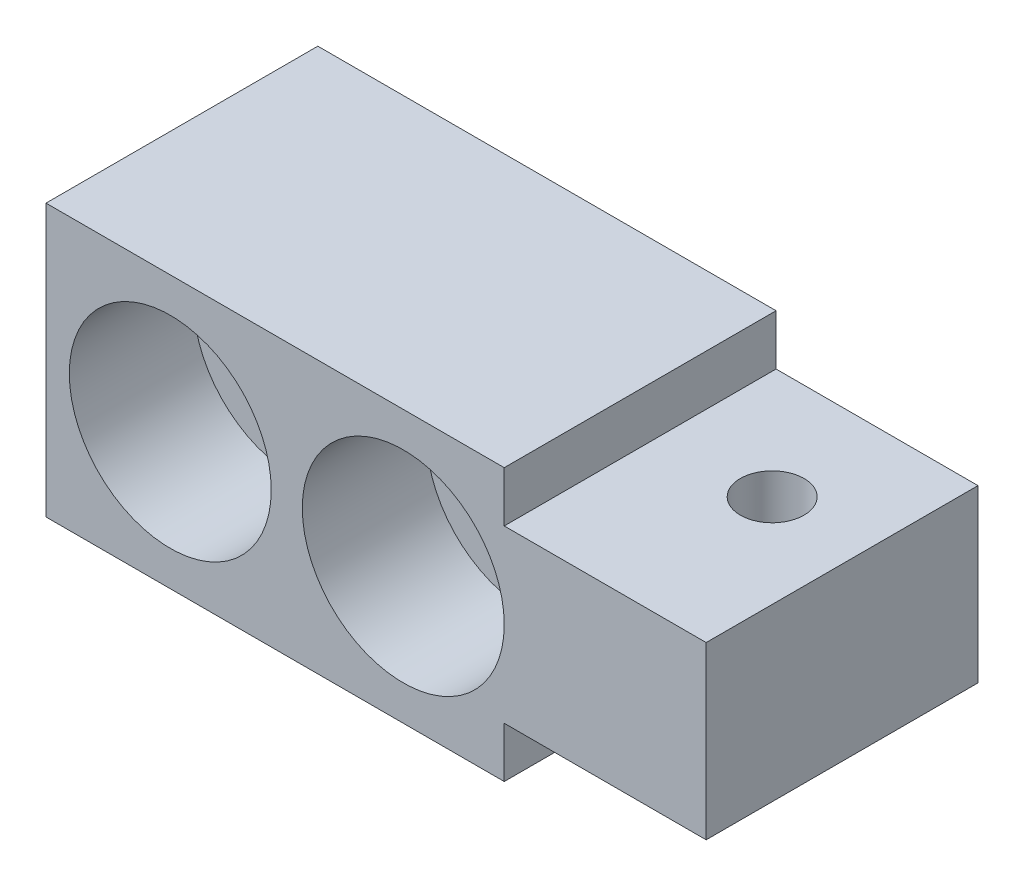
ISO-10303-21;
HEADER;
FILE_DESCRIPTION(('STEP AP214'),'2;1');
FILE_NAME('part.step','',(''),(''),'','','');
FILE_SCHEMA(('AUTOMOTIVE_DESIGN { 1 0 10303 214 1 1 1 1 }'));
ENDSEC;
DATA;
#1=APPLICATION_CONTEXT('core data for automotive mechanical design processes');
#2=APPLICATION_PROTOCOL_DEFINITION('international standard','automotive_design',2000,#1);
#3=PRODUCT_CONTEXT('',#1,'mechanical');
#4=PRODUCT('Part','Part','',(#3));
#5=PRODUCT_RELATED_PRODUCT_CATEGORY('part','',(#4));
#6=PRODUCT_DEFINITION_FORMATION('','',#4);
#7=PRODUCT_DEFINITION_CONTEXT('part definition',#1,'design');
#8=PRODUCT_DEFINITION('design','',#6,#7);
#9=PRODUCT_DEFINITION_SHAPE('','',#8);
#10=(LENGTH_UNIT() NAMED_UNIT(*) SI_UNIT(.MILLI.,.METRE.));
#11=(NAMED_UNIT(*) PLANE_ANGLE_UNIT() SI_UNIT($,.RADIAN.));
#12=(NAMED_UNIT(*) SI_UNIT($,.STERADIAN.) SOLID_ANGLE_UNIT());
#13=UNCERTAINTY_MEASURE_WITH_UNIT(LENGTH_MEASURE(1.E-05),#10,'distance_accuracy_value','');
#14=(GEOMETRIC_REPRESENTATION_CONTEXT(3) GLOBAL_UNCERTAINTY_ASSIGNED_CONTEXT((#13)) GLOBAL_UNIT_ASSIGNED_CONTEXT((#10,
#11,#12)) REPRESENTATION_CONTEXT('',''));
#15=CARTESIAN_POINT('',(0.,0.,0.));
#16=DIRECTION('',(0.,0.,1.));
#17=DIRECTION('',(1.,0.,0.));
#18=AXIS2_PLACEMENT_3D('',#15,#16,#17);
#19=CARTESIAN_POINT('',(69.,17.5,35.));
#20=DIRECTION('',(0.,0.,-1.));
#21=DIRECTION('',(1.,0.,0.));
#22=AXIS2_PLACEMENT_3D('',#19,#20,#21);
#23=PLANE('',#22);
#24=CARTESIAN_POINT('',(0.,0.,35.));
#25=DIRECTION('',(0.,0.,1.));
#26=DIRECTION('',(-1.,0.,0.));
#27=AXIS2_PLACEMENT_3D('',#24,#25,#26);
#28=CIRCLE('',#27,13.);
#29=CARTESIAN_POINT('',(-13.,0.,35.));
#30=VERTEX_POINT('',#29);
#31=EDGE_CURVE('E157',#30,#30,#28,.T.);
#32=ORIENTED_EDGE('',*,*,#31,.F.);
#33=EDGE_LOOP('',(#32));
#34=FACE_BOUND('',#33,.T.);
#35=DIRECTION('',(0.,1.,0.));
#36=VECTOR('',#35,1.);
#37=CARTESIAN_POINT('',(43.,11.,35.));
#38=LINE('',#37,#36);
#39=CARTESIAN_POINT('',(43.,11.,35.));
#40=VERTEX_POINT('',#39);
#41=CARTESIAN_POINT('',(43.,17.5,35.));
#42=VERTEX_POINT('',#41);
#43=EDGE_CURVE('E88',#40,#42,#38,.T.);
#44=ORIENTED_EDGE('',*,*,#43,.T.);
#45=DIRECTION('',(-1.,0.,0.));
#46=VECTOR('',#45,1.);
#47=CARTESIAN_POINT('',(69.,17.5,35.));
#48=LINE('',#47,#46);
#49=CARTESIAN_POINT('',(-16.,17.5,35.));
#50=VERTEX_POINT('',#49);
#51=EDGE_CURVE('E22',#42,#50,#48,.T.);
#52=ORIENTED_EDGE('',*,*,#51,.T.);
#53=DIRECTION('',(0.,-1.,0.));
#54=VECTOR('',#53,1.);
#55=CARTESIAN_POINT('',(-16.,17.5,35.));
#56=LINE('',#55,#54);
#57=CARTESIAN_POINT('',(-16.,-17.5,35.));
#58=VERTEX_POINT('',#57);
#59=EDGE_CURVE('E129',#50,#58,#56,.T.);
#60=ORIENTED_EDGE('',*,*,#59,.T.);
#61=DIRECTION('',(-1.,0.,0.));
#62=VECTOR('',#61,1.);
#63=CARTESIAN_POINT('',(69.,-17.5,35.));
#64=LINE('',#63,#62);
#65=CARTESIAN_POINT('',(43.,-17.5,35.));
#66=VERTEX_POINT('',#65);
#67=EDGE_CURVE('E140',#66,#58,#64,.T.);
#68=ORIENTED_EDGE('',*,*,#67,.F.);
#69=DIRECTION('',(0.,-1.,0.));
#70=VECTOR('',#69,1.);
#71=CARTESIAN_POINT('',(43.,-11.,35.));
#72=LINE('',#71,#70);
#73=CARTESIAN_POINT('',(43.,-11.,35.));
#74=VERTEX_POINT('',#73);
#75=EDGE_CURVE('E108',#74,#66,#72,.T.);
#76=ORIENTED_EDGE('',*,*,#75,.F.);
#77=DIRECTION('',(1.,0.,0.));
#78=VECTOR('',#77,1.);
#79=CARTESIAN_POINT('',(43.,-11.,35.));
#80=LINE('',#79,#78);
#81=CARTESIAN_POINT('',(69.,-11.,35.));
#82=VERTEX_POINT('',#81);
#83=EDGE_CURVE('E110',#74,#82,#80,.T.);
#84=ORIENTED_EDGE('',*,*,#83,.T.);
#85=DIRECTION('',(0.,-1.,0.));
#86=VECTOR('',#85,1.);
#87=CARTESIAN_POINT('',(69.,17.5,35.));
#88=LINE('',#87,#86);
#89=CARTESIAN_POINT('',(69.,11.,35.));
#90=VERTEX_POINT('',#89);
#91=EDGE_CURVE('E99',#90,#82,#88,.T.);
#92=ORIENTED_EDGE('',*,*,#91,.F.);
#93=DIRECTION('',(1.,0.,0.));
#94=VECTOR('',#93,1.);
#95=CARTESIAN_POINT('',(43.,11.,35.));
#96=LINE('',#95,#94);
#97=EDGE_CURVE('E82',#40,#90,#96,.T.);
#98=ORIENTED_EDGE('',*,*,#97,.F.);
#99=EDGE_LOOP('',(#44,#52,#60,#68,#76,#84,#92,#98));
#100=FACE_BOUND('',#99,.T.);
#101=CARTESIAN_POINT('',(30.,0.,35.));
#102=DIRECTION('',(0.,0.,1.));
#103=DIRECTION('',(-1.,0.,0.));
#104=AXIS2_PLACEMENT_3D('',#101,#102,#103);
#105=CIRCLE('',#104,13.);
#106=CARTESIAN_POINT('',(17.,0.,35.));
#107=VERTEX_POINT('',#106);
#108=EDGE_CURVE('E168',#107,#107,#105,.T.);
#109=ORIENTED_EDGE('',*,*,#108,.F.);
#110=EDGE_LOOP('',(#109));
#111=FACE_BOUND('',#110,.T.);
#112=ADVANCED_FACE('F14',(#34,#100,#111),#23,.F.);
#113=CARTESIAN_POINT('',(69.,-17.5,0.));
#114=DIRECTION('',(0.,0.,1.));
#115=DIRECTION('',(0.,1.,0.));
#116=AXIS2_PLACEMENT_3D('',#113,#114,#115);
#117=PLANE('',#116);
#118=CARTESIAN_POINT('',(0.,0.,0.));
#119=DIRECTION('',(0.,0.,1.));
#120=DIRECTION('',(0.,1.,0.));
#121=AXIS2_PLACEMENT_3D('',#118,#119,#120);
#122=CIRCLE('',#121,8.5);
#123=CARTESIAN_POINT('',(0.,8.5,0.));
#124=VERTEX_POINT('',#123);
#125=EDGE_CURVE('E145',#124,#124,#122,.F.);
#126=ORIENTED_EDGE('',*,*,#125,.F.);
#127=EDGE_LOOP('',(#126));
#128=FACE_BOUND('',#127,.T.);
#129=DIRECTION('',(0.,1.,0.));
#130=VECTOR('',#129,1.);
#131=CARTESIAN_POINT('',(43.,11.,0.));
#132=LINE('',#131,#130);
#133=CARTESIAN_POINT('',(43.,11.,0.));
#134=VERTEX_POINT('',#133);
#135=CARTESIAN_POINT('',(43.,17.5,0.));
#136=VERTEX_POINT('',#135);
#137=EDGE_CURVE('E100',#134,#136,#132,.T.);
#138=ORIENTED_EDGE('',*,*,#137,.F.);
#139=DIRECTION('',(1.,0.,0.));
#140=VECTOR('',#139,1.);
#141=CARTESIAN_POINT('',(43.,11.,0.));
#142=LINE('',#141,#140);
#143=CARTESIAN_POINT('',(69.,11.,0.));
#144=VERTEX_POINT('',#143);
#145=EDGE_CURVE('E83',#134,#144,#142,.T.);
#146=ORIENTED_EDGE('',*,*,#145,.T.);
#147=DIRECTION('',(0.,1.,0.));
#148=VECTOR('',#147,1.);
#149=CARTESIAN_POINT('',(69.,-17.5,0.));
#150=LINE('',#149,#148);
#151=CARTESIAN_POINT('',(69.,-11.,0.));
#152=VERTEX_POINT('',#151);
#153=EDGE_CURVE('E132',#152,#144,#150,.T.);
#154=ORIENTED_EDGE('',*,*,#153,.F.);
#155=DIRECTION('',(1.,0.,0.));
#156=VECTOR('',#155,1.);
#157=CARTESIAN_POINT('',(43.,-11.,0.));
#158=LINE('',#157,#156);
#159=CARTESIAN_POINT('',(43.,-11.,0.));
#160=VERTEX_POINT('',#159);
#161=EDGE_CURVE('E38',#160,#152,#158,.T.);
#162=ORIENTED_EDGE('',*,*,#161,.F.);
#163=DIRECTION('',(0.,-1.,0.));
#164=VECTOR('',#163,1.);
#165=CARTESIAN_POINT('',(43.,-11.,0.));
#166=LINE('',#165,#164);
#167=CARTESIAN_POINT('',(43.,-17.5,0.));
#168=VERTEX_POINT('',#167);
#169=EDGE_CURVE('E112',#160,#168,#166,.T.);
#170=ORIENTED_EDGE('',*,*,#169,.T.);
#171=DIRECTION('',(-1.,0.,0.));
#172=VECTOR('',#171,1.);
#173=CARTESIAN_POINT('',(69.,-17.5,0.));
#174=LINE('',#173,#172);
#175=CARTESIAN_POINT('',(-16.,-17.5,0.));
#176=VERTEX_POINT('',#175);
#177=EDGE_CURVE('E138',#168,#176,#174,.T.);
#178=ORIENTED_EDGE('',*,*,#177,.T.);
#179=DIRECTION('',(0.,1.,0.));
#180=VECTOR('',#179,1.);
#181=CARTESIAN_POINT('',(-16.,-17.5,0.));
#182=LINE('',#181,#180);
#183=CARTESIAN_POINT('',(-16.,17.5,0.));
#184=VERTEX_POINT('',#183);
#185=EDGE_CURVE('E123',#176,#184,#182,.T.);
#186=ORIENTED_EDGE('',*,*,#185,.T.);
#187=DIRECTION('',(-1.,0.,0.));
#188=VECTOR('',#187,1.);
#189=CARTESIAN_POINT('',(69.,17.5,0.));
#190=LINE('',#189,#188);
#191=EDGE_CURVE('E136',#136,#184,#190,.T.);
#192=ORIENTED_EDGE('',*,*,#191,.F.);
#193=EDGE_LOOP('',(#138,#146,#154,#162,#170,#178,#186,#192));
#194=FACE_BOUND('',#193,.T.);
#195=CARTESIAN_POINT('',(30.,0.,0.));
#196=DIRECTION('',(0.,0.,1.));
#197=DIRECTION('',(0.,1.,0.));
#198=AXIS2_PLACEMENT_3D('',#195,#196,#197);
#199=CIRCLE('',#198,8.5);
#200=CARTESIAN_POINT('',(30.,8.5,0.));
#201=VERTEX_POINT('',#200);
#202=EDGE_CURVE('E17',#201,#201,#199,.F.);
#203=ORIENTED_EDGE('',*,*,#202,.F.);
#204=EDGE_LOOP('',(#203));
#205=FACE_BOUND('',#204,.T.);
#206=ADVANCED_FACE('F175',(#128,#194,#205),#117,.F.);
#207=CARTESIAN_POINT('',(69.,17.5,35.));
#208=DIRECTION('',(0.,1.,0.));
#209=DIRECTION('',(0.,0.,-1.));
#210=AXIS2_PLACEMENT_3D('',#207,#208,#209);
#211=PLANE('',#210);
#212=ORIENTED_EDGE('',*,*,#51,.F.);
#213=DIRECTION('',(0.,0.,-1.));
#214=VECTOR('',#213,1.);
#215=CARTESIAN_POINT('',(43.,17.5,35.));
#216=LINE('',#215,#214);
#217=EDGE_CURVE('E91',#42,#136,#216,.T.);
#218=ORIENTED_EDGE('',*,*,#217,.T.);
#219=ORIENTED_EDGE('',*,*,#191,.T.);
#220=DIRECTION('',(0.,0.,-1.));
#221=VECTOR('',#220,1.);
#222=CARTESIAN_POINT('',(-16.,17.5,35.));
#223=LINE('',#222,#221);
#224=EDGE_CURVE('E120',#50,#184,#223,.T.);
#225=ORIENTED_EDGE('',*,*,#224,.F.);
#226=EDGE_LOOP('',(#212,#218,#219,#225));
#227=FACE_BOUND('',#226,.T.);
#228=ADVANCED_FACE('F182',(#227),#211,.T.);
#229=CARTESIAN_POINT('',(69.,17.5,0.));
#230=DIRECTION('',(1.,0.,0.));
#231=DIRECTION('',(0.,1.,0.));
#232=AXIS2_PLACEMENT_3D('',#229,#230,#231);
#233=PLANE('',#232);
#234=DIRECTION('',(0.,0.,-1.));
#235=VECTOR('',#234,1.);
#236=CARTESIAN_POINT('',(69.,11.,0.));
#237=LINE('',#236,#235);
#238=EDGE_CURVE('E30',#90,#144,#237,.T.);
#239=ORIENTED_EDGE('',*,*,#238,.F.);
#240=ORIENTED_EDGE('',*,*,#91,.T.);
#241=DIRECTION('',(0.,0.,-1.));
#242=VECTOR('',#241,1.);
#243=CARTESIAN_POINT('',(69.,-11.,0.));
#244=LINE('',#243,#242);
#245=EDGE_CURVE('E9',#82,#152,#244,.T.);
#246=ORIENTED_EDGE('',*,*,#245,.T.);
#247=ORIENTED_EDGE('',*,*,#153,.T.);
#248=EDGE_LOOP('',(#239,#240,#246,#247));
#249=FACE_BOUND('',#248,.T.);
#250=ADVANCED_FACE('F228',(#249),#233,.T.);
#251=CARTESIAN_POINT('',(69.,-17.5,0.));
#252=DIRECTION('',(0.,-1.,0.));
#253=DIRECTION('',(1.,0.,0.));
#254=AXIS2_PLACEMENT_3D('',#251,#252,#253);
#255=PLANE('',#254);
#256=DIRECTION('',(0.,0.,-1.));
#257=VECTOR('',#256,1.);
#258=CARTESIAN_POINT('',(43.,-17.5,0.));
#259=LINE('',#258,#257);
#260=EDGE_CURVE('E118',#66,#168,#259,.T.);
#261=ORIENTED_EDGE('',*,*,#260,.F.);
#262=ORIENTED_EDGE('',*,*,#67,.T.);
#263=DIRECTION('',(0.,0.,1.));
#264=VECTOR('',#263,1.);
#265=CARTESIAN_POINT('',(-16.,-17.5,0.));
#266=LINE('',#265,#264);
#267=EDGE_CURVE('E126',#176,#58,#266,.T.);
#268=ORIENTED_EDGE('',*,*,#267,.F.);
#269=ORIENTED_EDGE('',*,*,#177,.F.);
#270=EDGE_LOOP('',(#261,#262,#268,#269));
#271=FACE_BOUND('',#270,.T.);
#272=ADVANCED_FACE('F226',(#271),#255,.T.);
#273=CARTESIAN_POINT('',(-16.,17.5,0.));
#274=DIRECTION('',(1.,0.,0.));
#275=DIRECTION('',(0.,1.,0.));
#276=AXIS2_PLACEMENT_3D('',#273,#274,#275);
#277=PLANE('',#276);
#278=ORIENTED_EDGE('',*,*,#224,.T.);
#279=ORIENTED_EDGE('',*,*,#185,.F.);
#280=ORIENTED_EDGE('',*,*,#267,.T.);
#281=ORIENTED_EDGE('',*,*,#59,.F.);
#282=EDGE_LOOP('',(#278,#279,#280,#281));
#283=FACE_BOUND('',#282,.T.);
#284=ADVANCED_FACE('F222',(#283),#277,.F.);
#285=CARTESIAN_POINT('',(43.,-11.,0.));
#286=DIRECTION('',(-1.,0.,0.));
#287=DIRECTION('',(0.,-1.,0.));
#288=AXIS2_PLACEMENT_3D('',#285,#286,#287);
#289=PLANE('',#288);
#290=ORIENTED_EDGE('',*,*,#260,.T.);
#291=ORIENTED_EDGE('',*,*,#169,.F.);
#292=DIRECTION('',(0.,0.,1.));
#293=VECTOR('',#292,1.);
#294=CARTESIAN_POINT('',(43.,-11.,0.));
#295=LINE('',#294,#293);
#296=EDGE_CURVE('E116',#160,#74,#295,.T.);
#297=ORIENTED_EDGE('',*,*,#296,.T.);
#298=ORIENTED_EDGE('',*,*,#75,.T.);
#299=EDGE_LOOP('',(#290,#291,#297,#298));
#300=FACE_BOUND('',#299,.T.);
#301=ADVANCED_FACE('F218',(#300),#289,.F.);
#302=CARTESIAN_POINT('',(43.,-11.,0.));
#303=DIRECTION('',(0.,-1.,0.));
#304=DIRECTION('',(1.,0.,0.));
#305=AXIS2_PLACEMENT_3D('',#302,#303,#304);
#306=PLANE('',#305);
#307=CARTESIAN_POINT('',(57.,-11.,14.5));
#308=DIRECTION('',(0.,-1.,0.));
#309=DIRECTION('',(1.,0.,0.));
#310=AXIS2_PLACEMENT_3D('',#307,#308,#309);
#311=CIRCLE('',#310,4.1);
#312=CARTESIAN_POINT('',(61.1,-11.,14.5));
#313=VERTEX_POINT('',#312);
#314=EDGE_CURVE('E144',#313,#313,#311,.T.);
#315=ORIENTED_EDGE('',*,*,#314,.F.);
#316=EDGE_LOOP('',(#315));
#317=FACE_BOUND('',#316,.T.);
#318=ORIENTED_EDGE('',*,*,#83,.F.);
#319=ORIENTED_EDGE('',*,*,#296,.F.);
#320=ORIENTED_EDGE('',*,*,#161,.T.);
#321=ORIENTED_EDGE('',*,*,#245,.F.);
#322=EDGE_LOOP('',(#318,#319,#320,#321));
#323=FACE_BOUND('',#322,.T.);
#324=ADVANCED_FACE('F212',(#317,#323),#306,.T.);
#325=CARTESIAN_POINT('',(43.,11.,0.));
#326=DIRECTION('',(1.,0.,0.));
#327=DIRECTION('',(0.,1.,0.));
#328=AXIS2_PLACEMENT_3D('',#325,#326,#327);
#329=PLANE('',#328);
#330=ORIENTED_EDGE('',*,*,#43,.F.);
#331=DIRECTION('',(0.,0.,1.));
#332=VECTOR('',#331,1.);
#333=CARTESIAN_POINT('',(43.,11.,0.));
#334=LINE('',#333,#332);
#335=EDGE_CURVE('E78',#134,#40,#334,.T.);
#336=ORIENTED_EDGE('',*,*,#335,.F.);
#337=ORIENTED_EDGE('',*,*,#137,.T.);
#338=ORIENTED_EDGE('',*,*,#217,.F.);
#339=EDGE_LOOP('',(#330,#336,#337,#338));
#340=FACE_BOUND('',#339,.T.);
#341=ADVANCED_FACE('F89',(#340),#329,.T.);
#342=CARTESIAN_POINT('',(43.,11.,0.));
#343=DIRECTION('',(0.,-1.,0.));
#344=DIRECTION('',(1.,0.,0.));
#345=AXIS2_PLACEMENT_3D('',#342,#343,#344);
#346=PLANE('',#345);
#347=CARTESIAN_POINT('',(57.,11.,14.5));
#348=DIRECTION('',(0.,-1.,0.));
#349=DIRECTION('',(1.,0.,0.));
#350=AXIS2_PLACEMENT_3D('',#347,#348,#349);
#351=CIRCLE('',#350,4.1);
#352=CARTESIAN_POINT('',(61.1,11.,14.5));
#353=VERTEX_POINT('',#352);
#354=EDGE_CURVE('E94',#353,#353,#351,.T.);
#355=ORIENTED_EDGE('',*,*,#354,.T.);
#356=EDGE_LOOP('',(#355));
#357=FACE_BOUND('',#356,.T.);
#358=ORIENTED_EDGE('',*,*,#238,.T.);
#359=ORIENTED_EDGE('',*,*,#145,.F.);
#360=ORIENTED_EDGE('',*,*,#335,.T.);
#361=ORIENTED_EDGE('',*,*,#97,.T.);
#362=EDGE_LOOP('',(#358,#359,#360,#361));
#363=FACE_BOUND('',#362,.T.);
#364=ADVANCED_FACE('F80',(#357,#363),#346,.F.);
#365=CARTESIAN_POINT('',(57.,17.5,14.5));
#366=DIRECTION('',(0.,-1.,0.));
#367=DIRECTION('',(1.,0.,0.));
#368=AXIS2_PLACEMENT_3D('',#365,#366,#367);
#369=CYLINDRICAL_SURFACE('',#368,4.1);
#370=ORIENTED_EDGE('',*,*,#314,.T.);
#371=EDGE_LOOP('',(#370));
#372=FACE_BOUND('',#371,.T.);
#373=ORIENTED_EDGE('',*,*,#354,.F.);
#374=EDGE_LOOP('',(#373));
#375=FACE_BOUND('',#374,.T.);
#376=ADVANCED_FACE('F203',(#372,#375),#369,.F.);
#377=CARTESIAN_POINT('',(0.,0.,35.));
#378=DIRECTION('',(0.,0.,1.));
#379=DIRECTION('',(-1.,0.,0.));
#380=AXIS2_PLACEMENT_3D('',#377,#378,#379);
#381=CYLINDRICAL_SURFACE('',#380,8.5);
#382=CARTESIAN_POINT('',(0.,0.,19.));
#383=DIRECTION('',(0.,0.,1.));
#384=DIRECTION('',(-1.,0.,0.));
#385=AXIS2_PLACEMENT_3D('',#382,#383,#384);
#386=CIRCLE('',#385,8.5);
#387=CARTESIAN_POINT('',(-8.5,0.,19.));
#388=VERTEX_POINT('',#387);
#389=EDGE_CURVE('E147',#388,#388,#386,.T.);
#390=ORIENTED_EDGE('',*,*,#389,.T.);
#391=EDGE_LOOP('',(#390));
#392=FACE_BOUND('',#391,.T.);
#393=ORIENTED_EDGE('',*,*,#125,.T.);
#394=EDGE_LOOP('',(#393));
#395=FACE_BOUND('',#394,.T.);
#396=ADVANCED_FACE('F197',(#392,#395),#381,.F.);
#397=CARTESIAN_POINT('',(0.,-8.5,19.));
#398=DIRECTION('',(0.,0.,1.));
#399=DIRECTION('',(-1.,0.,0.));
#400=AXIS2_PLACEMENT_3D('',#397,#398,#399);
#401=PLANE('',#400);
#402=CARTESIAN_POINT('',(0.,0.,19.));
#403=DIRECTION('',(0.,0.,1.));
#404=DIRECTION('',(-1.,0.,0.));
#405=AXIS2_PLACEMENT_3D('',#402,#403,#404);
#406=CIRCLE('',#405,13.);
#407=CARTESIAN_POINT('',(-13.,0.,19.));
#408=VERTEX_POINT('',#407);
#409=EDGE_CURVE('E152',#408,#408,#406,.T.);
#410=ORIENTED_EDGE('',*,*,#409,.T.);
#411=EDGE_LOOP('',(#410));
#412=FACE_BOUND('',#411,.T.);
#413=ORIENTED_EDGE('',*,*,#389,.F.);
#414=EDGE_LOOP('',(#413));
#415=FACE_BOUND('',#414,.T.);
#416=ADVANCED_FACE('F191',(#412,#415),#401,.T.);
#417=CARTESIAN_POINT('',(0.,0.,35.));
#418=DIRECTION('',(0.,0.,1.));
#419=DIRECTION('',(-1.,0.,0.));
#420=AXIS2_PLACEMENT_3D('',#417,#418,#419);
#421=CYLINDRICAL_SURFACE('',#420,13.);
#422=ORIENTED_EDGE('',*,*,#31,.T.);
#423=EDGE_LOOP('',(#422));
#424=FACE_BOUND('',#423,.T.);
#425=ORIENTED_EDGE('',*,*,#409,.F.);
#426=EDGE_LOOP('',(#425));
#427=FACE_BOUND('',#426,.T.);
#428=ADVANCED_FACE('F187',(#424,#427),#421,.F.);
#429=CARTESIAN_POINT('',(30.,0.,35.));
#430=DIRECTION('',(0.,0.,1.));
#431=DIRECTION('',(-1.,0.,0.));
#432=AXIS2_PLACEMENT_3D('',#429,#430,#431);
#433=CYLINDRICAL_SURFACE('',#432,8.5);
#434=CARTESIAN_POINT('',(30.,0.,19.));
#435=DIRECTION('',(0.,0.,1.));
#436=DIRECTION('',(-1.,0.,0.));
#437=AXIS2_PLACEMENT_3D('',#434,#435,#436);
#438=CIRCLE('',#437,8.5);
#439=CARTESIAN_POINT('',(21.5,0.,19.));
#440=VERTEX_POINT('',#439);
#441=EDGE_CURVE('E162',#440,#440,#438,.T.);
#442=ORIENTED_EDGE('',*,*,#441,.T.);
#443=EDGE_LOOP('',(#442));
#444=FACE_BOUND('',#443,.T.);
#445=ORIENTED_EDGE('',*,*,#202,.T.);
#446=EDGE_LOOP('',(#445));
#447=FACE_BOUND('',#446,.T.);
#448=ADVANCED_FACE('F190',(#444,#447),#433,.F.);
#449=CARTESIAN_POINT('',(30.,-8.5,19.));
#450=DIRECTION('',(0.,0.,1.));
#451=DIRECTION('',(-1.,0.,0.));
#452=AXIS2_PLACEMENT_3D('',#449,#450,#451);
#453=PLANE('',#452);
#454=CARTESIAN_POINT('',(30.,0.,19.));
#455=DIRECTION('',(0.,0.,1.));
#456=DIRECTION('',(-1.,0.,0.));
#457=AXIS2_PLACEMENT_3D('',#454,#455,#456);
#458=CIRCLE('',#457,13.);
#459=CARTESIAN_POINT('',(17.,0.,19.));
#460=VERTEX_POINT('',#459);
#461=EDGE_CURVE('E165',#460,#460,#458,.T.);
#462=ORIENTED_EDGE('',*,*,#461,.T.);
#463=EDGE_LOOP('',(#462));
#464=FACE_BOUND('',#463,.T.);
#465=ORIENTED_EDGE('',*,*,#441,.F.);
#466=EDGE_LOOP('',(#465));
#467=FACE_BOUND('',#466,.T.);
#468=ADVANCED_FACE('F257',(#464,#467),#453,.T.);
#469=CARTESIAN_POINT('',(30.,0.,35.));
#470=DIRECTION('',(0.,0.,1.));
#471=DIRECTION('',(-1.,0.,0.));
#472=AXIS2_PLACEMENT_3D('',#469,#470,#471);
#473=CYLINDRICAL_SURFACE('',#472,13.);
#474=ORIENTED_EDGE('',*,*,#108,.T.);
#475=EDGE_LOOP('',(#474));
#476=FACE_BOUND('',#475,.T.);
#477=ORIENTED_EDGE('',*,*,#461,.F.);
#478=EDGE_LOOP('',(#477));
#479=FACE_BOUND('',#478,.T.);
#480=ADVANCED_FACE('F172',(#476,#479),#473,.F.);
#481=CLOSED_SHELL('',(#112,#206,#228,#250,#272,#284,#301,#324,#341,#364,#376,#396,#416,#428,
#448,#468,#480));
#482=MANIFOLD_SOLID_BREP('B1',#481);
#483=ADVANCED_BREP_SHAPE_REPRESENTATION('',(#18,#482),#14);
#484=SHAPE_DEFINITION_REPRESENTATION(#9,#483);
ENDSEC;
END-ISO-10303-21;
